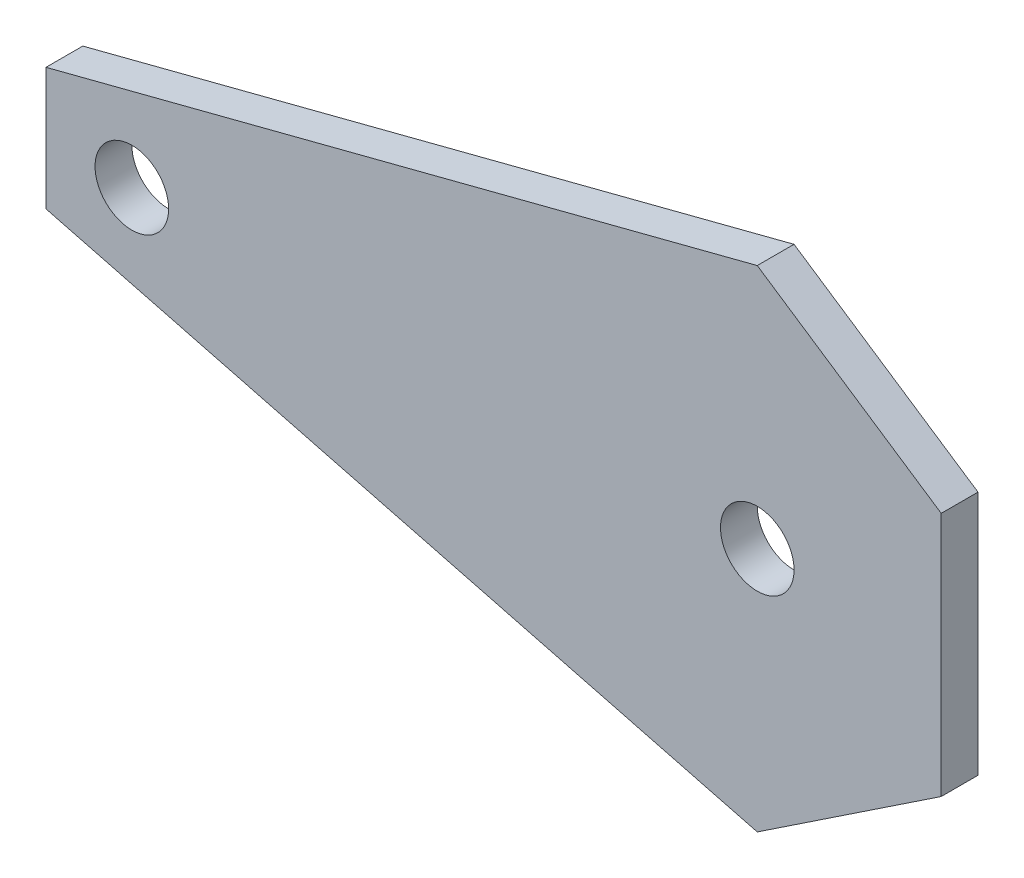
from build123d import *

# Parameters (mm, degrees)
SKETCH1_R           = 3
BOSS_EXTRUDE1_DEPTH = 3


with BuildPart() as part:
    # Sketch1 → Boss-Extrude1 (new body)
    with BuildSketch(Plane.XY):
        Polygon((15, 10), (15, -10), (0, -20), (-58, -5), (-58, 5), (0, 20), align=None)
        Circle(SKETCH1_R, mode=Mode.SUBTRACT)
        with Locations((-51, 0)):
            Circle(SKETCH1_R, mode=Mode.SUBTRACT)
    extrude(amount=BOSS_EXTRUDE1_DEPTH)


solid = part.part
